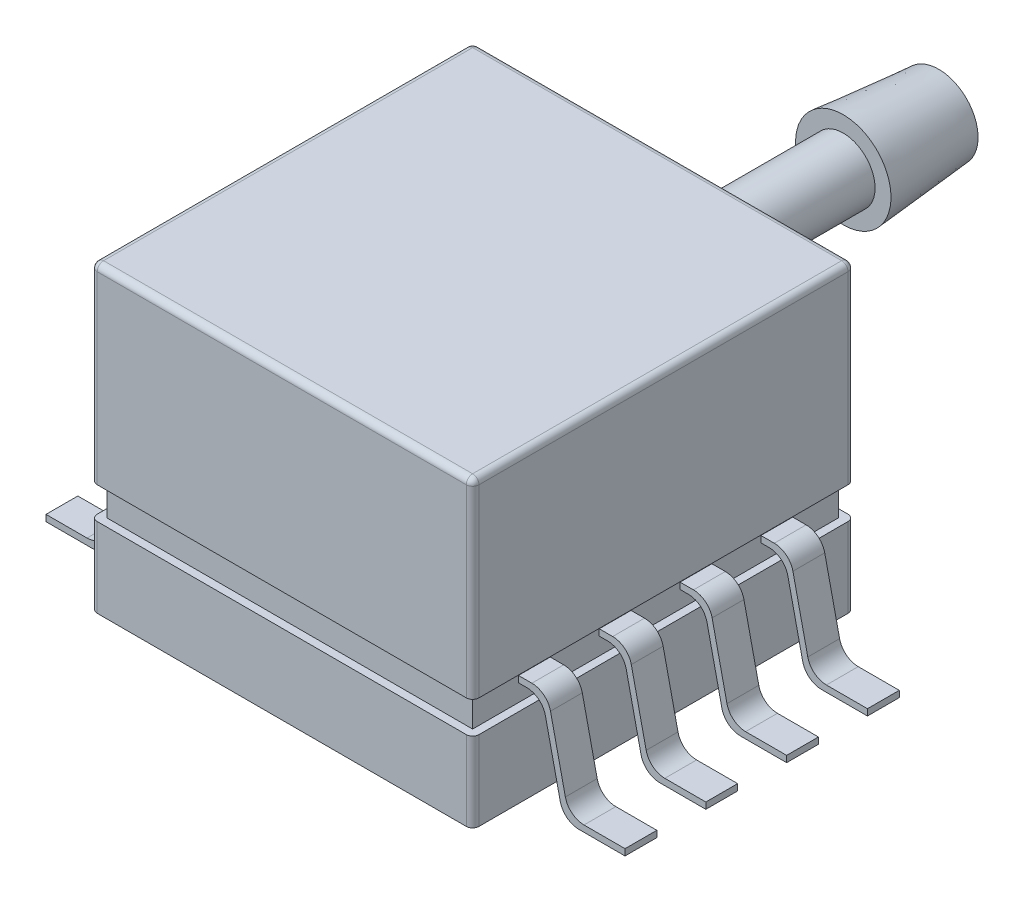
from build123d import *

# Parameters (mm, degrees)
ESBO_O1_W                          = 11.5
ESBO_O1_H                          = 11.5
RESSALTO_EXTRUS_O1_DEPTH           = 1
ESBO_O5_W                          = 12
ESBO_O5_H                          = 12
RESSALTO_EXTRUS_O3_DEPTH           = 2.5
RESSALTO_EXTRUS_O2_DEPTH           = 0.5
PADR_O_LINEAR1_COUNT               = 4
PADR_O_LINEAR1_PITCH               = 2.54
ESBO_O6_W                          = 12
ESBO_O6_H                          = 12
RESSALTO_EXTRUS_O4_DEPTH           = 6
FILETE1_R                          = 0.2
ESBO_O7_R                          = 1
RESSALTO_EXTRUS_O5_DEPTH           = 3.5
ESBO_O8_R                          = 1.5
RESSALTO_EXTRUS_O6_DEPTH           = 3
RESSALTO_EXTRUS_O6_DRAFT           = 5
RESSALTO_EXTRUS_O6_PROFILE_2_DEPTH = 3
RESSALTO_EXTRUS_O6_PROFILE_2_DRAFT = 5
ESBO_O9_R                          = 0.9
CORTE_EXTRUS_O1_DEPTH              = 13


with BuildPart() as part:
    # Esbo_o1 → Ressalto-extrus_o1 (new body)
    with BuildSketch(Plane(origin=(0, 0, 0), x_dir=(1, 0, 0), z_dir=(0, 1, 0))):
        Rectangle(ESBO_O1_W, ESBO_O1_H)
    extrude(amount=-RESSALTO_EXTRUS_O1_DEPTH)

    # Esbo_o5 → Ressalto-extrus_o3 (add)
    with BuildSketch(Plane.XZ.offset(1)):
        Rectangle(ESBO_O5_W, ESBO_O5_H)
    extrude(amount=RESSALTO_EXTRUS_O3_DEPTH)

    # Esbo_o4 → Ressalto-extrus_o2 (add, symmetric)
    with BuildSketch(Plane.XY.offset(3.81)):
        with BuildLine():
            Line((-5.086501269, -0.259759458), (-6.171927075, -0.259759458))
            ThreePointArc((-6.171927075, -0.259759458), (-6.547314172, -0.391694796), (-6.757611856, -0.7294777))
            Line((-6.757611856, -0.7294777), (-7.224922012, -2.830281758))
            ThreePointArc((-7.224922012, -2.830281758), (-7.435219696, -3.168064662), (-7.810606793, -3.3))
            Line((-7.810606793, -3.3), (-9.1, -3.3))
            Line((-9.1, -3.3), (-9.1, -3.5))
            Line((-9.1, -3.5), (-7.650207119, -3.5))
            ThreePointArc((-7.650207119, -3.5), (-7.274820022, -3.368064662), (-7.064522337, -3.030281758))
            Line((-7.064522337, -3.030281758), (-6.597212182, -0.9294777))
            ThreePointArc((-6.597212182, -0.9294777), (-6.386914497, -0.591694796), (-6.0115274, -0.459759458))
            Line((-6.0115274, -0.459759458), (-5.086501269, -0.459759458))
            Line((-5.086501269, -0.459759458), (-5.086501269, -0.259759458))
        make_face()
        with BuildLine():
            Line((5.086501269, -0.459759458), (5.086501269, -0.259759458))
            Line((5.086501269, -0.259759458), (6.171927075, -0.259759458))
            ThreePointArc((6.171927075, -0.259759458), (6.547314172, -0.391694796), (6.757611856, -0.7294777))
            Line((6.757611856, -0.7294777), (7.224922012, -2.830281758))
            ThreePointArc((7.224922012, -2.830281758), (7.435219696, -3.168064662), (7.810606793, -3.3))
            Line((7.810606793, -3.3), (9.1, -3.3))
            Line((9.1, -3.3), (9.1, -3.5))
            Line((9.1, -3.5), (7.650207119, -3.5))
            ThreePointArc((7.650207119, -3.5), (7.274820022, -3.368064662), (7.064522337, -3.030281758))
            Line((7.064522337, -3.030281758), (6.597212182, -0.9294777))
            ThreePointArc((6.597212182, -0.9294777), (6.386914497, -0.591694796), (6.0115274, -0.459759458))
            Line((6.0115274, -0.459759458), (5.086501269, -0.459759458))
        make_face()
    ressalto_extrus_o2 = extrude(amount=RESSALTO_EXTRUS_O2_DEPTH, both=True)

    # Padr_o linear1: Ressalto-extrus_o2 ×4
    with Locations(*[(0, 0, -i * PADR_O_LINEAR1_PITCH) for i in range(1, PADR_O_LINEAR1_COUNT)]):
        add(ressalto_extrus_o2)

    # Esbo_o6 → Ressalto-extrus_o4 (add)
    with BuildSketch(Plane(origin=(0, 0, 0), x_dir=(1, 0, 0), z_dir=(0, 1, 0))):
        Rectangle(ESBO_O6_W, ESBO_O6_H)
    extrude(amount=RESSALTO_EXTRUS_O4_DEPTH)

    # Filete1
    filete1_edges = [part.edges().sort_by_distance(p)[0] for p in [
        (6, -2.25, -6),
        (6, -2.25, 6),
        (-6, -2.25, 6),
        (-6, -2.25, -6),
        (6, 3, 6),
        (6, 3, -6),
        (-6, 3, -6),
        (-6, 3, 6),
        (6, 6, 0),
        (0, 6, -6),
        (-6, 6, 0),
        (0, 6, 6),
    ]]
    fillet(filete1_edges, radius=FILETE1_R)

    # Esbo_o7 → Ressalto-extrus_o5 (add)
    with BuildSketch(Plane(origin=(0, 0, -6), x_dir=(-1, 0, 0), z_dir=(0, 0, -1))):
        with Locations(Location((-2.15, 4.8, 0), (0, 0, 90))):
            Circle(ESBO_O7_R)
        with Locations(Location((2.15, -2.5, 0), (0, 0, 270))):
            Circle(ESBO_O7_R)
    extrude(amount=RESSALTO_EXTRUS_O5_DEPTH)


with BuildPart() as ressalto_extrus_o6_tool:
    # Esbo_o8 → Ressalto-extrus_o6 (with draft: the straight prism first)
    with BuildSketch(Plane(origin=(0, 0, -9.5), x_dir=(-1, 0, 0), z_dir=(0, 0, -1))):
        with Locations((-2.15, 4.8)):
            Circle(ESBO_O8_R)
    extrude(amount=RESSALTO_EXTRUS_O6_DEPTH)
    # Ressalto-extrus_o6: the draft: its side faces are tilted about the plane it starts from
    ressalto_extrus_o6_sides = [ressalto_extrus_o6_tool.faces().sort_by_distance(p)[0] for p in [
        (3.65, 4.8, -11),
    ]]
    draft(ressalto_extrus_o6_sides, Plane(origin=(0, 0, -9.5), x_dir=(-1, 0, 0), z_dir=(0, 0, -1)), RESSALTO_EXTRUS_O6_DRAFT)


with BuildPart() as part_1:
    add(part.part)

    # Ressalto-extrus_o6: add ressalto_extrus_o6_tool
    add(ressalto_extrus_o6_tool.part)


with BuildPart() as ressalto_extrus_o6_profile_2_tool:
    # Esbo_o8 → Ressalto-extrus_o6 profile 2 (with draft: the straight prism first)
    with BuildSketch(Plane(origin=(0, 0, -9.5), x_dir=(-1, 0, 0), z_dir=(0, 0, -1))):
        with Locations((2.15, -2.5)):
            Circle(ESBO_O8_R)
    extrude(amount=RESSALTO_EXTRUS_O6_PROFILE_2_DEPTH)
    # Ressalto-extrus_o6 profile 2: the draft: its side faces are tilted about the plane it starts from
    ressalto_extrus_o6_profile_2_sides = [ressalto_extrus_o6_profile_2_tool.faces().sort_by_distance(p)[0] for p in [
        (-0.65, -2.5, -11),
    ]]
    draft(ressalto_extrus_o6_profile_2_sides, Plane(origin=(0, 0, -9.5), x_dir=(-1, 0, 0), z_dir=(0, 0, -1)), RESSALTO_EXTRUS_O6_PROFILE_2_DRAFT)


with BuildPart() as part_2:
    add(part_1.part)

    # Ressalto-extrus_o6 profile 2: add ressalto_extrus_o6_profile_2_tool
    add(ressalto_extrus_o6_profile_2_tool.part)

    # Esbo_o9 → Corte-extrus_o1 (cut)
    with BuildSketch(Plane(origin=(0, 0, -12.5), x_dir=(-1, 0, 0), z_dir=(0, 0, -1))):
        with Locations((-2.15, 4.8)):
            Circle(ESBO_O9_R)
        with Locations((2.15, -2.5)):
            Circle(ESBO_O9_R)
    extrude(amount=-CORTE_EXTRUS_O1_DEPTH, mode=Mode.SUBTRACT)


solid = part_2.part
